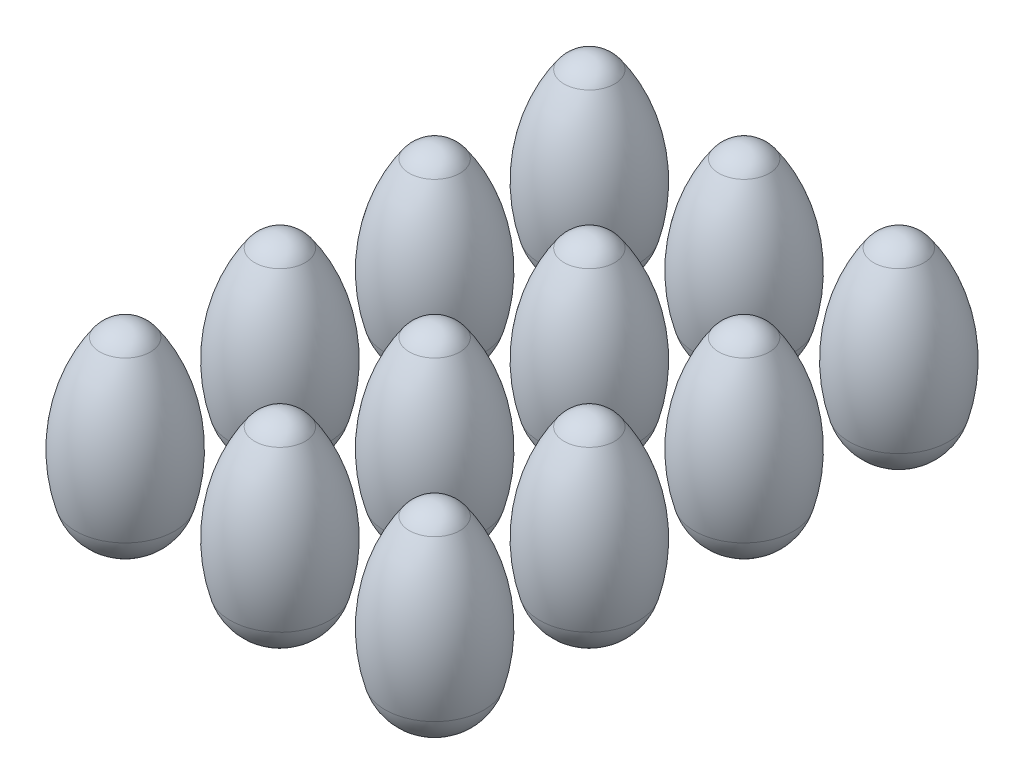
ISO-10303-21;
HEADER;
FILE_DESCRIPTION(('STEP AP214'),'2;1');
FILE_NAME('part.step','',(''),(''),'','','');
FILE_SCHEMA(('AUTOMOTIVE_DESIGN { 1 0 10303 214 1 1 1 1 }'));
ENDSEC;
DATA;
#1=APPLICATION_CONTEXT('core data for automotive mechanical design processes');
#2=APPLICATION_PROTOCOL_DEFINITION('international standard','automotive_design',2000,#1);
#3=PRODUCT_CONTEXT('',#1,'mechanical');
#4=PRODUCT('Part','Part','',(#3));
#5=PRODUCT_RELATED_PRODUCT_CATEGORY('part','',(#4));
#6=PRODUCT_DEFINITION_FORMATION('','',#4);
#7=PRODUCT_DEFINITION_CONTEXT('part definition',#1,'design');
#8=PRODUCT_DEFINITION('design','',#6,#7);
#9=PRODUCT_DEFINITION_SHAPE('','',#8);
#10=(LENGTH_UNIT() NAMED_UNIT(*) SI_UNIT(.MILLI.,.METRE.));
#11=(NAMED_UNIT(*) PLANE_ANGLE_UNIT() SI_UNIT($,.RADIAN.));
#12=(NAMED_UNIT(*) SI_UNIT($,.STERADIAN.) SOLID_ANGLE_UNIT());
#13=UNCERTAINTY_MEASURE_WITH_UNIT(LENGTH_MEASURE(1.E-05),#10,'distance_accuracy_value','');
#14=(GEOMETRIC_REPRESENTATION_CONTEXT(3) GLOBAL_UNCERTAINTY_ASSIGNED_CONTEXT((#13)) GLOBAL_UNIT_ASSIGNED_CONTEXT((#10,
#11,#12)) REPRESENTATION_CONTEXT('',''));
#15=CARTESIAN_POINT('',(0.,0.,0.));
#16=DIRECTION('',(0.,0.,1.));
#17=DIRECTION('',(1.,0.,0.));
#18=AXIS2_PLACEMENT_3D('',#15,#16,#17);
#19=CARTESIAN_POINT('',(-120.,63.,-180.));
#20=DIRECTION('',(0.,-1.,0.));
#21=DIRECTION('',(1.,0.,0.));
#22=AXIS2_PLACEMENT_3D('',#19,#20,#21);
#23=SPHERICAL_SURFACE('',#22,12.);
#24=CARTESIAN_POINT('',(-120.,69.9319877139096,-180.));
#25=DIRECTION('',(0.,-1.,0.));
#26=DIRECTION('',(0.,0.,-1.));
#27=AXIS2_PLACEMENT_3D('',#24,#25,#26);
#28=CIRCLE('',#27,9.79528184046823);
#29=CARTESIAN_POINT('',(-120.,69.9319877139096,-189.795281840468));
#30=VERTEX_POINT('',#29);
#31=EDGE_CURVE('E39',#30,#30,#28,.T.);
#32=ORIENTED_EDGE('',*,*,#31,.F.);
#33=EDGE_LOOP('',(#32));
#34=FACE_BOUND('',#33,.T.);
#35=ADVANCED_FACE('F33',(#34),#23,.T.);
#36=CARTESIAN_POINT('',(-120.,20.,-180.));
#37=DIRECTION('',(0.,-1.,0.));
#38=DIRECTION('',(1.,0.,0.));
#39=AXIS2_PLACEMENT_3D('',#36,#37,#38);
#40=SPHERICAL_SURFACE('',#39,20.);
#41=CARTESIAN_POINT('',(-120.,14.4961240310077,-180.));
#42=DIRECTION('',(0.,-1.,0.));
#43=DIRECTION('',(0.,0.,-1.));
#44=AXIS2_PLACEMENT_3D('',#41,#42,#43);
#45=CIRCLE('',#44,19.2277754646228);
#46=CARTESIAN_POINT('',(-120.,14.4961240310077,-199.227775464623));
#47=VERTEX_POINT('',#46);
#48=EDGE_CURVE('E11',#47,#47,#45,.T.);
#49=ORIENTED_EDGE('',*,*,#48,.T.);
#50=EDGE_LOOP('',(#49));
#51=FACE_BOUND('',#50,.T.);
#52=ADVANCED_FACE('F49',(#51),#40,.T.);
#53=CARTESIAN_POINT('',(-120.,32.3837209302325,-180.));
#54=DIRECTION('',(0.,-1.,0.));
#55=DIRECTION('',(0.,0.,-1.));
#56=AXIS2_PLACEMENT_3D('',#53,#54,#55);
#57=DEGENERATE_TOROIDAL_SURFACE('',#56,43.2624947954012,65.,.F.);
#58=ORIENTED_EDGE('',*,*,#31,.T.);
#59=EDGE_LOOP('',(#58));
#60=FACE_BOUND('',#59,.T.);
#61=ORIENTED_EDGE('',*,*,#48,.F.);
#62=EDGE_LOOP('',(#61));
#63=FACE_BOUND('',#62,.T.);
#64=ADVANCED_FACE('F45',(#60,#63),#57,.F.);
#65=CLOSED_SHELL('',(#35,#52,#64));
#66=MANIFOLD_SOLID_BREP('B2',#65);
#67=CARTESIAN_POINT('',(-120.,63.,-120.));
#68=DIRECTION('',(0.,-1.,0.));
#69=DIRECTION('',(1.,0.,0.));
#70=AXIS2_PLACEMENT_3D('',#67,#68,#69);
#71=SPHERICAL_SURFACE('',#70,12.);
#72=CARTESIAN_POINT('',(-120.,69.9319877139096,-120.));
#73=DIRECTION('',(0.,-1.,0.));
#74=DIRECTION('',(0.,0.,-1.));
#75=AXIS2_PLACEMENT_3D('',#72,#73,#74);
#76=CIRCLE('',#75,9.79528184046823);
#77=CARTESIAN_POINT('',(-120.,69.9319877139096,-129.795281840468));
#78=VERTEX_POINT('',#77);
#79=EDGE_CURVE('E81',#78,#78,#76,.T.);
#80=ORIENTED_EDGE('',*,*,#79,.F.);
#81=EDGE_LOOP('',(#80));
#82=FACE_BOUND('',#81,.T.);
#83=ADVANCED_FACE('F75',(#82),#71,.T.);
#84=CARTESIAN_POINT('',(-120.,20.,-120.));
#85=DIRECTION('',(0.,-1.,0.));
#86=DIRECTION('',(1.,0.,0.));
#87=AXIS2_PLACEMENT_3D('',#84,#85,#86);
#88=SPHERICAL_SURFACE('',#87,20.);
#89=CARTESIAN_POINT('',(-120.,14.4961240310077,-120.));
#90=DIRECTION('',(0.,-1.,0.));
#91=DIRECTION('',(0.,0.,-1.));
#92=AXIS2_PLACEMENT_3D('',#89,#90,#91);
#93=CIRCLE('',#92,19.2277754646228);
#94=CARTESIAN_POINT('',(-120.,14.4961240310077,-139.227775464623));
#95=VERTEX_POINT('',#94);
#96=EDGE_CURVE('E32',#95,#95,#93,.T.);
#97=ORIENTED_EDGE('',*,*,#96,.T.);
#98=EDGE_LOOP('',(#97));
#99=FACE_BOUND('',#98,.T.);
#100=ADVANCED_FACE('F91',(#99),#88,.T.);
#101=CARTESIAN_POINT('',(-120.,32.3837209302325,-120.));
#102=DIRECTION('',(0.,-1.,0.));
#103=DIRECTION('',(0.,0.,-1.));
#104=AXIS2_PLACEMENT_3D('',#101,#102,#103);
#105=DEGENERATE_TOROIDAL_SURFACE('',#104,43.2624947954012,65.,.F.);
#106=ORIENTED_EDGE('',*,*,#79,.T.);
#107=EDGE_LOOP('',(#106));
#108=FACE_BOUND('',#107,.T.);
#109=ORIENTED_EDGE('',*,*,#96,.F.);
#110=EDGE_LOOP('',(#109));
#111=FACE_BOUND('',#110,.T.);
#112=ADVANCED_FACE('F87',(#108,#111),#105,.F.);
#113=CLOSED_SHELL('',(#83,#100,#112));
#114=MANIFOLD_SOLID_BREP('B6',#113);
#115=CARTESIAN_POINT('',(-120.,63.,-60.));
#116=DIRECTION('',(0.,-1.,0.));
#117=DIRECTION('',(1.,0.,0.));
#118=AXIS2_PLACEMENT_3D('',#115,#116,#117);
#119=SPHERICAL_SURFACE('',#118,12.);
#120=CARTESIAN_POINT('',(-120.,69.9319877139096,-60.));
#121=DIRECTION('',(0.,-1.,0.));
#122=DIRECTION('',(0.,0.,-1.));
#123=AXIS2_PLACEMENT_3D('',#120,#121,#122);
#124=CIRCLE('',#123,9.79528184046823);
#125=CARTESIAN_POINT('',(-120.,69.9319877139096,-69.7952818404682));
#126=VERTEX_POINT('',#125);
#127=EDGE_CURVE('E123',#126,#126,#124,.T.);
#128=ORIENTED_EDGE('',*,*,#127,.F.);
#129=EDGE_LOOP('',(#128));
#130=FACE_BOUND('',#129,.T.);
#131=ADVANCED_FACE('F117',(#130),#119,.T.);
#132=CARTESIAN_POINT('',(-120.,20.,-60.));
#133=DIRECTION('',(0.,-1.,0.));
#134=DIRECTION('',(1.,0.,0.));
#135=AXIS2_PLACEMENT_3D('',#132,#133,#134);
#136=SPHERICAL_SURFACE('',#135,20.);
#137=CARTESIAN_POINT('',(-120.,14.4961240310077,-60.));
#138=DIRECTION('',(0.,-1.,0.));
#139=DIRECTION('',(0.,0.,-1.));
#140=AXIS2_PLACEMENT_3D('',#137,#138,#139);
#141=CIRCLE('',#140,19.2277754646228);
#142=CARTESIAN_POINT('',(-120.,14.4961240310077,-79.2277754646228));
#143=VERTEX_POINT('',#142);
#144=EDGE_CURVE('E74',#143,#143,#141,.T.);
#145=ORIENTED_EDGE('',*,*,#144,.T.);
#146=EDGE_LOOP('',(#145));
#147=FACE_BOUND('',#146,.T.);
#148=ADVANCED_FACE('F133',(#147),#136,.T.);
#149=CARTESIAN_POINT('',(-120.,32.3837209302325,-60.));
#150=DIRECTION('',(0.,-1.,0.));
#151=DIRECTION('',(0.,0.,-1.));
#152=AXIS2_PLACEMENT_3D('',#149,#150,#151);
#153=DEGENERATE_TOROIDAL_SURFACE('',#152,43.2624947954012,65.,.F.);
#154=ORIENTED_EDGE('',*,*,#127,.T.);
#155=EDGE_LOOP('',(#154));
#156=FACE_BOUND('',#155,.T.);
#157=ORIENTED_EDGE('',*,*,#144,.F.);
#158=EDGE_LOOP('',(#157));
#159=FACE_BOUND('',#158,.T.);
#160=ADVANCED_FACE('F129',(#156,#159),#153,.F.);
#161=CLOSED_SHELL('',(#131,#148,#160));
#162=MANIFOLD_SOLID_BREP('B27',#161);
#163=CARTESIAN_POINT('',(-120.,63.,0.));
#164=DIRECTION('',(0.,-1.,0.));
#165=DIRECTION('',(1.,0.,0.));
#166=AXIS2_PLACEMENT_3D('',#163,#164,#165);
#167=SPHERICAL_SURFACE('',#166,12.);
#168=CARTESIAN_POINT('',(-120.,69.9319877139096,0.));
#169=DIRECTION('',(0.,-1.,0.));
#170=DIRECTION('',(0.,0.,-1.));
#171=AXIS2_PLACEMENT_3D('',#168,#169,#170);
#172=CIRCLE('',#171,9.79528184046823);
#173=CARTESIAN_POINT('',(-120.,69.9319877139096,-9.79528184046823));
#174=VERTEX_POINT('',#173);
#175=EDGE_CURVE('E165',#174,#174,#172,.T.);
#176=ORIENTED_EDGE('',*,*,#175,.F.);
#177=EDGE_LOOP('',(#176));
#178=FACE_BOUND('',#177,.T.);
#179=ADVANCED_FACE('F159',(#178),#167,.T.);
#180=CARTESIAN_POINT('',(-120.,20.,0.));
#181=DIRECTION('',(0.,-1.,0.));
#182=DIRECTION('',(1.,0.,0.));
#183=AXIS2_PLACEMENT_3D('',#180,#181,#182);
#184=SPHERICAL_SURFACE('',#183,20.);
#185=CARTESIAN_POINT('',(-120.,14.4961240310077,0.));
#186=DIRECTION('',(0.,-1.,0.));
#187=DIRECTION('',(0.,0.,-1.));
#188=AXIS2_PLACEMENT_3D('',#185,#186,#187);
#189=CIRCLE('',#188,19.2277754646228);
#190=CARTESIAN_POINT('',(-120.,14.4961240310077,-19.2277754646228));
#191=VERTEX_POINT('',#190);
#192=EDGE_CURVE('E116',#191,#191,#189,.T.);
#193=ORIENTED_EDGE('',*,*,#192,.T.);
#194=EDGE_LOOP('',(#193));
#195=FACE_BOUND('',#194,.T.);
#196=ADVANCED_FACE('F175',(#195),#184,.T.);
#197=CARTESIAN_POINT('',(-120.,32.3837209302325,0.));
#198=DIRECTION('',(0.,-1.,0.));
#199=DIRECTION('',(0.,0.,-1.));
#200=AXIS2_PLACEMENT_3D('',#197,#198,#199);
#201=DEGENERATE_TOROIDAL_SURFACE('',#200,43.2624947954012,65.,.F.);
#202=ORIENTED_EDGE('',*,*,#175,.T.);
#203=EDGE_LOOP('',(#202));
#204=FACE_BOUND('',#203,.T.);
#205=ORIENTED_EDGE('',*,*,#192,.F.);
#206=EDGE_LOOP('',(#205));
#207=FACE_BOUND('',#206,.T.);
#208=ADVANCED_FACE('F171',(#204,#207),#201,.F.);
#209=CLOSED_SHELL('',(#179,#196,#208));
#210=MANIFOLD_SOLID_BREP('B69',#209);
#211=CARTESIAN_POINT('',(-60.,63.,-180.));
#212=DIRECTION('',(0.,-1.,0.));
#213=DIRECTION('',(1.,0.,0.));
#214=AXIS2_PLACEMENT_3D('',#211,#212,#213);
#215=SPHERICAL_SURFACE('',#214,12.);
#216=CARTESIAN_POINT('',(-60.,69.9319877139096,-180.));
#217=DIRECTION('',(0.,-1.,0.));
#218=DIRECTION('',(0.,0.,-1.));
#219=AXIS2_PLACEMENT_3D('',#216,#217,#218);
#220=CIRCLE('',#219,9.79528184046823);
#221=CARTESIAN_POINT('',(-60.,69.9319877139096,-189.795281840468));
#222=VERTEX_POINT('',#221);
#223=EDGE_CURVE('E207',#222,#222,#220,.T.);
#224=ORIENTED_EDGE('',*,*,#223,.F.);
#225=EDGE_LOOP('',(#224));
#226=FACE_BOUND('',#225,.T.);
#227=ADVANCED_FACE('F201',(#226),#215,.T.);
#228=CARTESIAN_POINT('',(-60.,20.,-180.));
#229=DIRECTION('',(0.,-1.,0.));
#230=DIRECTION('',(1.,0.,0.));
#231=AXIS2_PLACEMENT_3D('',#228,#229,#230);
#232=SPHERICAL_SURFACE('',#231,20.);
#233=CARTESIAN_POINT('',(-60.,14.4961240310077,-180.));
#234=DIRECTION('',(0.,-1.,0.));
#235=DIRECTION('',(0.,0.,-1.));
#236=AXIS2_PLACEMENT_3D('',#233,#234,#235);
#237=CIRCLE('',#236,19.2277754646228);
#238=CARTESIAN_POINT('',(-60.,14.4961240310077,-199.227775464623));
#239=VERTEX_POINT('',#238);
#240=EDGE_CURVE('E158',#239,#239,#237,.T.);
#241=ORIENTED_EDGE('',*,*,#240,.T.);
#242=EDGE_LOOP('',(#241));
#243=FACE_BOUND('',#242,.T.);
#244=ADVANCED_FACE('F217',(#243),#232,.T.);
#245=CARTESIAN_POINT('',(-60.,32.3837209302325,-180.));
#246=DIRECTION('',(0.,-1.,0.));
#247=DIRECTION('',(0.,0.,-1.));
#248=AXIS2_PLACEMENT_3D('',#245,#246,#247);
#249=DEGENERATE_TOROIDAL_SURFACE('',#248,43.2624947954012,65.,.F.);
#250=ORIENTED_EDGE('',*,*,#223,.T.);
#251=EDGE_LOOP('',(#250));
#252=FACE_BOUND('',#251,.T.);
#253=ORIENTED_EDGE('',*,*,#240,.F.);
#254=EDGE_LOOP('',(#253));
#255=FACE_BOUND('',#254,.T.);
#256=ADVANCED_FACE('F213',(#252,#255),#249,.F.);
#257=CLOSED_SHELL('',(#227,#244,#256));
#258=MANIFOLD_SOLID_BREP('B111',#257);
#259=CARTESIAN_POINT('',(-60.,63.,-120.));
#260=DIRECTION('',(0.,-1.,0.));
#261=DIRECTION('',(1.,0.,0.));
#262=AXIS2_PLACEMENT_3D('',#259,#260,#261);
#263=SPHERICAL_SURFACE('',#262,12.);
#264=CARTESIAN_POINT('',(-60.,69.9319877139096,-120.));
#265=DIRECTION('',(0.,-1.,0.));
#266=DIRECTION('',(0.,0.,-1.));
#267=AXIS2_PLACEMENT_3D('',#264,#265,#266);
#268=CIRCLE('',#267,9.79528184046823);
#269=CARTESIAN_POINT('',(-60.,69.9319877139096,-129.795281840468));
#270=VERTEX_POINT('',#269);
#271=EDGE_CURVE('E249',#270,#270,#268,.T.);
#272=ORIENTED_EDGE('',*,*,#271,.F.);
#273=EDGE_LOOP('',(#272));
#274=FACE_BOUND('',#273,.T.);
#275=ADVANCED_FACE('F243',(#274),#263,.T.);
#276=CARTESIAN_POINT('',(-60.,20.,-120.));
#277=DIRECTION('',(0.,-1.,0.));
#278=DIRECTION('',(1.,0.,0.));
#279=AXIS2_PLACEMENT_3D('',#276,#277,#278);
#280=SPHERICAL_SURFACE('',#279,20.);
#281=CARTESIAN_POINT('',(-60.,14.4961240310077,-120.));
#282=DIRECTION('',(0.,-1.,0.));
#283=DIRECTION('',(0.,0.,-1.));
#284=AXIS2_PLACEMENT_3D('',#281,#282,#283);
#285=CIRCLE('',#284,19.2277754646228);
#286=CARTESIAN_POINT('',(-60.,14.4961240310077,-139.227775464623));
#287=VERTEX_POINT('',#286);
#288=EDGE_CURVE('E200',#287,#287,#285,.T.);
#289=ORIENTED_EDGE('',*,*,#288,.T.);
#290=EDGE_LOOP('',(#289));
#291=FACE_BOUND('',#290,.T.);
#292=ADVANCED_FACE('F259',(#291),#280,.T.);
#293=CARTESIAN_POINT('',(-60.,32.3837209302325,-120.));
#294=DIRECTION('',(0.,-1.,0.));
#295=DIRECTION('',(0.,0.,-1.));
#296=AXIS2_PLACEMENT_3D('',#293,#294,#295);
#297=DEGENERATE_TOROIDAL_SURFACE('',#296,43.2624947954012,65.,.F.);
#298=ORIENTED_EDGE('',*,*,#271,.T.);
#299=EDGE_LOOP('',(#298));
#300=FACE_BOUND('',#299,.T.);
#301=ORIENTED_EDGE('',*,*,#288,.F.);
#302=EDGE_LOOP('',(#301));
#303=FACE_BOUND('',#302,.T.);
#304=ADVANCED_FACE('F255',(#300,#303),#297,.F.);
#305=CLOSED_SHELL('',(#275,#292,#304));
#306=MANIFOLD_SOLID_BREP('B153',#305);
#307=CARTESIAN_POINT('',(-60.,63.,-60.));
#308=DIRECTION('',(0.,-1.,0.));
#309=DIRECTION('',(1.,0.,0.));
#310=AXIS2_PLACEMENT_3D('',#307,#308,#309);
#311=SPHERICAL_SURFACE('',#310,12.);
#312=CARTESIAN_POINT('',(-60.,69.9319877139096,-60.));
#313=DIRECTION('',(0.,-1.,0.));
#314=DIRECTION('',(0.,0.,-1.));
#315=AXIS2_PLACEMENT_3D('',#312,#313,#314);
#316=CIRCLE('',#315,9.79528184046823);
#317=CARTESIAN_POINT('',(-60.,69.9319877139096,-69.7952818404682));
#318=VERTEX_POINT('',#317);
#319=EDGE_CURVE('E291',#318,#318,#316,.T.);
#320=ORIENTED_EDGE('',*,*,#319,.F.);
#321=EDGE_LOOP('',(#320));
#322=FACE_BOUND('',#321,.T.);
#323=ADVANCED_FACE('F285',(#322),#311,.T.);
#324=CARTESIAN_POINT('',(-60.,20.,-60.));
#325=DIRECTION('',(0.,-1.,0.));
#326=DIRECTION('',(1.,0.,0.));
#327=AXIS2_PLACEMENT_3D('',#324,#325,#326);
#328=SPHERICAL_SURFACE('',#327,20.);
#329=CARTESIAN_POINT('',(-60.,14.4961240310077,-60.));
#330=DIRECTION('',(0.,-1.,0.));
#331=DIRECTION('',(0.,0.,-1.));
#332=AXIS2_PLACEMENT_3D('',#329,#330,#331);
#333=CIRCLE('',#332,19.2277754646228);
#334=CARTESIAN_POINT('',(-60.,14.4961240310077,-79.2277754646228));
#335=VERTEX_POINT('',#334);
#336=EDGE_CURVE('E242',#335,#335,#333,.T.);
#337=ORIENTED_EDGE('',*,*,#336,.T.);
#338=EDGE_LOOP('',(#337));
#339=FACE_BOUND('',#338,.T.);
#340=ADVANCED_FACE('F301',(#339),#328,.T.);
#341=CARTESIAN_POINT('',(-60.,32.3837209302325,-60.));
#342=DIRECTION('',(0.,-1.,0.));
#343=DIRECTION('',(0.,0.,-1.));
#344=AXIS2_PLACEMENT_3D('',#341,#342,#343);
#345=DEGENERATE_TOROIDAL_SURFACE('',#344,43.2624947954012,65.,.F.);
#346=ORIENTED_EDGE('',*,*,#319,.T.);
#347=EDGE_LOOP('',(#346));
#348=FACE_BOUND('',#347,.T.);
#349=ORIENTED_EDGE('',*,*,#336,.F.);
#350=EDGE_LOOP('',(#349));
#351=FACE_BOUND('',#350,.T.);
#352=ADVANCED_FACE('F297',(#348,#351),#345,.F.);
#353=CLOSED_SHELL('',(#323,#340,#352));
#354=MANIFOLD_SOLID_BREP('B195',#353);
#355=CARTESIAN_POINT('',(-60.,63.,0.));
#356=DIRECTION('',(0.,-1.,0.));
#357=DIRECTION('',(1.,0.,0.));
#358=AXIS2_PLACEMENT_3D('',#355,#356,#357);
#359=SPHERICAL_SURFACE('',#358,12.);
#360=CARTESIAN_POINT('',(-60.,69.9319877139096,0.));
#361=DIRECTION('',(0.,-1.,0.));
#362=DIRECTION('',(0.,0.,-1.));
#363=AXIS2_PLACEMENT_3D('',#360,#361,#362);
#364=CIRCLE('',#363,9.79528184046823);
#365=CARTESIAN_POINT('',(-60.,69.9319877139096,-9.79528184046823));
#366=VERTEX_POINT('',#365);
#367=EDGE_CURVE('E333',#366,#366,#364,.T.);
#368=ORIENTED_EDGE('',*,*,#367,.F.);
#369=EDGE_LOOP('',(#368));
#370=FACE_BOUND('',#369,.T.);
#371=ADVANCED_FACE('F327',(#370),#359,.T.);
#372=CARTESIAN_POINT('',(-60.,20.,0.));
#373=DIRECTION('',(0.,-1.,0.));
#374=DIRECTION('',(1.,0.,0.));
#375=AXIS2_PLACEMENT_3D('',#372,#373,#374);
#376=SPHERICAL_SURFACE('',#375,20.);
#377=CARTESIAN_POINT('',(-60.,14.4961240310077,0.));
#378=DIRECTION('',(0.,-1.,0.));
#379=DIRECTION('',(0.,0.,-1.));
#380=AXIS2_PLACEMENT_3D('',#377,#378,#379);
#381=CIRCLE('',#380,19.2277754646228);
#382=CARTESIAN_POINT('',(-60.,14.4961240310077,-19.2277754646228));
#383=VERTEX_POINT('',#382);
#384=EDGE_CURVE('E284',#383,#383,#381,.T.);
#385=ORIENTED_EDGE('',*,*,#384,.T.);
#386=EDGE_LOOP('',(#385));
#387=FACE_BOUND('',#386,.T.);
#388=ADVANCED_FACE('F343',(#387),#376,.T.);
#389=CARTESIAN_POINT('',(-60.,32.3837209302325,0.));
#390=DIRECTION('',(0.,-1.,0.));
#391=DIRECTION('',(0.,0.,-1.));
#392=AXIS2_PLACEMENT_3D('',#389,#390,#391);
#393=DEGENERATE_TOROIDAL_SURFACE('',#392,43.2624947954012,65.,.F.);
#394=ORIENTED_EDGE('',*,*,#367,.T.);
#395=EDGE_LOOP('',(#394));
#396=FACE_BOUND('',#395,.T.);
#397=ORIENTED_EDGE('',*,*,#384,.F.);
#398=EDGE_LOOP('',(#397));
#399=FACE_BOUND('',#398,.T.);
#400=ADVANCED_FACE('F339',(#396,#399),#393,.F.);
#401=CLOSED_SHELL('',(#371,#388,#400));
#402=MANIFOLD_SOLID_BREP('B237',#401);
#403=CARTESIAN_POINT('',(0.,63.,-180.));
#404=DIRECTION('',(0.,-1.,0.));
#405=DIRECTION('',(1.,0.,0.));
#406=AXIS2_PLACEMENT_3D('',#403,#404,#405);
#407=SPHERICAL_SURFACE('',#406,12.);
#408=CARTESIAN_POINT('',(0.,69.9319877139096,-180.));
#409=DIRECTION('',(0.,-1.,0.));
#410=DIRECTION('',(0.,0.,-1.));
#411=AXIS2_PLACEMENT_3D('',#408,#409,#410);
#412=CIRCLE('',#411,9.79528184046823);
#413=CARTESIAN_POINT('',(0.,69.9319877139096,-189.795281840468));
#414=VERTEX_POINT('',#413);
#415=EDGE_CURVE('E375',#414,#414,#412,.T.);
#416=ORIENTED_EDGE('',*,*,#415,.F.);
#417=EDGE_LOOP('',(#416));
#418=FACE_BOUND('',#417,.T.);
#419=ADVANCED_FACE('F369',(#418),#407,.T.);
#420=CARTESIAN_POINT('',(0.,20.,-180.));
#421=DIRECTION('',(0.,-1.,0.));
#422=DIRECTION('',(1.,0.,0.));
#423=AXIS2_PLACEMENT_3D('',#420,#421,#422);
#424=SPHERICAL_SURFACE('',#423,20.);
#425=CARTESIAN_POINT('',(0.,14.4961240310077,-180.));
#426=DIRECTION('',(0.,-1.,0.));
#427=DIRECTION('',(0.,0.,-1.));
#428=AXIS2_PLACEMENT_3D('',#425,#426,#427);
#429=CIRCLE('',#428,19.2277754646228);
#430=CARTESIAN_POINT('',(0.,14.4961240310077,-199.227775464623));
#431=VERTEX_POINT('',#430);
#432=EDGE_CURVE('E326',#431,#431,#429,.T.);
#433=ORIENTED_EDGE('',*,*,#432,.T.);
#434=EDGE_LOOP('',(#433));
#435=FACE_BOUND('',#434,.T.);
#436=ADVANCED_FACE('F385',(#435),#424,.T.);
#437=CARTESIAN_POINT('',(0.,32.3837209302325,-180.));
#438=DIRECTION('',(0.,-1.,0.));
#439=DIRECTION('',(0.,0.,-1.));
#440=AXIS2_PLACEMENT_3D('',#437,#438,#439);
#441=DEGENERATE_TOROIDAL_SURFACE('',#440,43.2624947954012,65.,.F.);
#442=ORIENTED_EDGE('',*,*,#415,.T.);
#443=EDGE_LOOP('',(#442));
#444=FACE_BOUND('',#443,.T.);
#445=ORIENTED_EDGE('',*,*,#432,.F.);
#446=EDGE_LOOP('',(#445));
#447=FACE_BOUND('',#446,.T.);
#448=ADVANCED_FACE('F381',(#444,#447),#441,.F.);
#449=CLOSED_SHELL('',(#419,#436,#448));
#450=MANIFOLD_SOLID_BREP('B279',#449);
#451=CARTESIAN_POINT('',(0.,63.,-120.));
#452=DIRECTION('',(0.,-1.,0.));
#453=DIRECTION('',(1.,0.,0.));
#454=AXIS2_PLACEMENT_3D('',#451,#452,#453);
#455=SPHERICAL_SURFACE('',#454,12.);
#456=CARTESIAN_POINT('',(0.,69.9319877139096,-120.));
#457=DIRECTION('',(0.,-1.,0.));
#458=DIRECTION('',(0.,0.,-1.));
#459=AXIS2_PLACEMENT_3D('',#456,#457,#458);
#460=CIRCLE('',#459,9.79528184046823);
#461=CARTESIAN_POINT('',(0.,69.9319877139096,-129.795281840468));
#462=VERTEX_POINT('',#461);
#463=EDGE_CURVE('E417',#462,#462,#460,.T.);
#464=ORIENTED_EDGE('',*,*,#463,.F.);
#465=EDGE_LOOP('',(#464));
#466=FACE_BOUND('',#465,.T.);
#467=ADVANCED_FACE('F411',(#466),#455,.T.);
#468=CARTESIAN_POINT('',(0.,20.,-120.));
#469=DIRECTION('',(0.,-1.,0.));
#470=DIRECTION('',(1.,0.,0.));
#471=AXIS2_PLACEMENT_3D('',#468,#469,#470);
#472=SPHERICAL_SURFACE('',#471,20.);
#473=CARTESIAN_POINT('',(0.,14.4961240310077,-120.));
#474=DIRECTION('',(0.,-1.,0.));
#475=DIRECTION('',(0.,0.,-1.));
#476=AXIS2_PLACEMENT_3D('',#473,#474,#475);
#477=CIRCLE('',#476,19.2277754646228);
#478=CARTESIAN_POINT('',(0.,14.4961240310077,-139.227775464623));
#479=VERTEX_POINT('',#478);
#480=EDGE_CURVE('E368',#479,#479,#477,.T.);
#481=ORIENTED_EDGE('',*,*,#480,.T.);
#482=EDGE_LOOP('',(#481));
#483=FACE_BOUND('',#482,.T.);
#484=ADVANCED_FACE('F427',(#483),#472,.T.);
#485=CARTESIAN_POINT('',(0.,32.3837209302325,-120.));
#486=DIRECTION('',(0.,-1.,0.));
#487=DIRECTION('',(0.,0.,-1.));
#488=AXIS2_PLACEMENT_3D('',#485,#486,#487);
#489=DEGENERATE_TOROIDAL_SURFACE('',#488,43.2624947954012,65.,.F.);
#490=ORIENTED_EDGE('',*,*,#463,.T.);
#491=EDGE_LOOP('',(#490));
#492=FACE_BOUND('',#491,.T.);
#493=ORIENTED_EDGE('',*,*,#480,.F.);
#494=EDGE_LOOP('',(#493));
#495=FACE_BOUND('',#494,.T.);
#496=ADVANCED_FACE('F423',(#492,#495),#489,.F.);
#497=CLOSED_SHELL('',(#467,#484,#496));
#498=MANIFOLD_SOLID_BREP('B321',#497);
#499=CARTESIAN_POINT('',(0.,63.,-60.));
#500=DIRECTION('',(0.,-1.,0.));
#501=DIRECTION('',(1.,0.,0.));
#502=AXIS2_PLACEMENT_3D('',#499,#500,#501);
#503=SPHERICAL_SURFACE('',#502,12.);
#504=CARTESIAN_POINT('',(0.,69.9319877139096,-60.));
#505=DIRECTION('',(0.,-1.,0.));
#506=DIRECTION('',(0.,0.,-1.));
#507=AXIS2_PLACEMENT_3D('',#504,#505,#506);
#508=CIRCLE('',#507,9.79528184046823);
#509=CARTESIAN_POINT('',(0.,69.9319877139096,-69.7952818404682));
#510=VERTEX_POINT('',#509);
#511=EDGE_CURVE('E458',#510,#510,#508,.T.);
#512=ORIENTED_EDGE('',*,*,#511,.F.);
#513=EDGE_LOOP('',(#512));
#514=FACE_BOUND('',#513,.T.);
#515=ADVANCED_FACE('F452',(#514),#503,.T.);
#516=CARTESIAN_POINT('',(0.,20.,-60.));
#517=DIRECTION('',(0.,-1.,0.));
#518=DIRECTION('',(1.,0.,0.));
#519=AXIS2_PLACEMENT_3D('',#516,#517,#518);
#520=SPHERICAL_SURFACE('',#519,20.);
#521=CARTESIAN_POINT('',(0.,14.4961240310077,-60.));
#522=DIRECTION('',(0.,-1.,0.));
#523=DIRECTION('',(0.,0.,-1.));
#524=AXIS2_PLACEMENT_3D('',#521,#522,#523);
#525=CIRCLE('',#524,19.2277754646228);
#526=CARTESIAN_POINT('',(0.,14.4961240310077,-79.2277754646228));
#527=VERTEX_POINT('',#526);
#528=EDGE_CURVE('E410',#527,#527,#525,.T.);
#529=ORIENTED_EDGE('',*,*,#528,.T.);
#530=EDGE_LOOP('',(#529));
#531=FACE_BOUND('',#530,.T.);
#532=ADVANCED_FACE('F468',(#531),#520,.T.);
#533=CARTESIAN_POINT('',(0.,32.3837209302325,-60.));
#534=DIRECTION('',(0.,-1.,0.));
#535=DIRECTION('',(0.,0.,-1.));
#536=AXIS2_PLACEMENT_3D('',#533,#534,#535);
#537=DEGENERATE_TOROIDAL_SURFACE('',#536,43.2624947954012,65.,.F.);
#538=ORIENTED_EDGE('',*,*,#511,.T.);
#539=EDGE_LOOP('',(#538));
#540=FACE_BOUND('',#539,.T.);
#541=ORIENTED_EDGE('',*,*,#528,.F.);
#542=EDGE_LOOP('',(#541));
#543=FACE_BOUND('',#542,.T.);
#544=ADVANCED_FACE('F464',(#540,#543),#537,.F.);
#545=CLOSED_SHELL('',(#515,#532,#544));
#546=MANIFOLD_SOLID_BREP('B363',#545);
#547=CARTESIAN_POINT('',(0.,63.,0.));
#548=DIRECTION('',(0.,-1.,0.));
#549=DIRECTION('',(1.,0.,0.));
#550=AXIS2_PLACEMENT_3D('',#547,#548,#549);
#551=SPHERICAL_SURFACE('',#550,12.);
#552=CARTESIAN_POINT('',(0.,69.9319877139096,0.));
#553=DIRECTION('',(0.,-1.,0.));
#554=DIRECTION('',(0.,0.,-1.));
#555=AXIS2_PLACEMENT_3D('',#552,#553,#554);
#556=CIRCLE('',#555,9.79528184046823);
#557=CARTESIAN_POINT('',(0.,69.9319877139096,-9.79528184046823));
#558=VERTEX_POINT('',#557);
#559=EDGE_CURVE('E492',#558,#558,#556,.T.);
#560=ORIENTED_EDGE('',*,*,#559,.F.);
#561=EDGE_LOOP('',(#560));
#562=FACE_BOUND('',#561,.T.);
#563=ADVANCED_FACE('F486',(#562),#551,.T.);
#564=CARTESIAN_POINT('',(0.,20.,0.));
#565=DIRECTION('',(0.,-1.,0.));
#566=DIRECTION('',(1.,0.,0.));
#567=AXIS2_PLACEMENT_3D('',#564,#565,#566);
#568=SPHERICAL_SURFACE('',#567,20.);
#569=CARTESIAN_POINT('',(0.,14.4961240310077,0.));
#570=DIRECTION('',(0.,-1.,0.));
#571=DIRECTION('',(0.,0.,-1.));
#572=AXIS2_PLACEMENT_3D('',#569,#570,#571);
#573=CIRCLE('',#572,19.2277754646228);
#574=CARTESIAN_POINT('',(0.,14.4961240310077,-19.2277754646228));
#575=VERTEX_POINT('',#574);
#576=EDGE_CURVE('E451',#575,#575,#573,.T.);
#577=ORIENTED_EDGE('',*,*,#576,.T.);
#578=EDGE_LOOP('',(#577));
#579=FACE_BOUND('',#578,.T.);
#580=ADVANCED_FACE('F502',(#579),#568,.T.);
#581=CARTESIAN_POINT('',(0.,32.3837209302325,0.));
#582=DIRECTION('',(0.,-1.,0.));
#583=DIRECTION('',(0.,0.,-1.));
#584=AXIS2_PLACEMENT_3D('',#581,#582,#583);
#585=DEGENERATE_TOROIDAL_SURFACE('',#584,43.2624947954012,65.,.F.);
#586=ORIENTED_EDGE('',*,*,#559,.T.);
#587=EDGE_LOOP('',(#586));
#588=FACE_BOUND('',#587,.T.);
#589=ORIENTED_EDGE('',*,*,#576,.F.);
#590=EDGE_LOOP('',(#589));
#591=FACE_BOUND('',#590,.T.);
#592=ADVANCED_FACE('F498',(#588,#591),#585,.F.);
#593=CLOSED_SHELL('',(#563,#580,#592));
#594=MANIFOLD_SOLID_BREP('B405',#593);
#595=ADVANCED_BREP_SHAPE_REPRESENTATION('',(#18,#66,#114,#162,#210,#258,#306,#354,#402,#450,
#498,#546,#594),#14);
#596=SHAPE_DEFINITION_REPRESENTATION(#9,#595);
ENDSEC;
END-ISO-10303-21;
